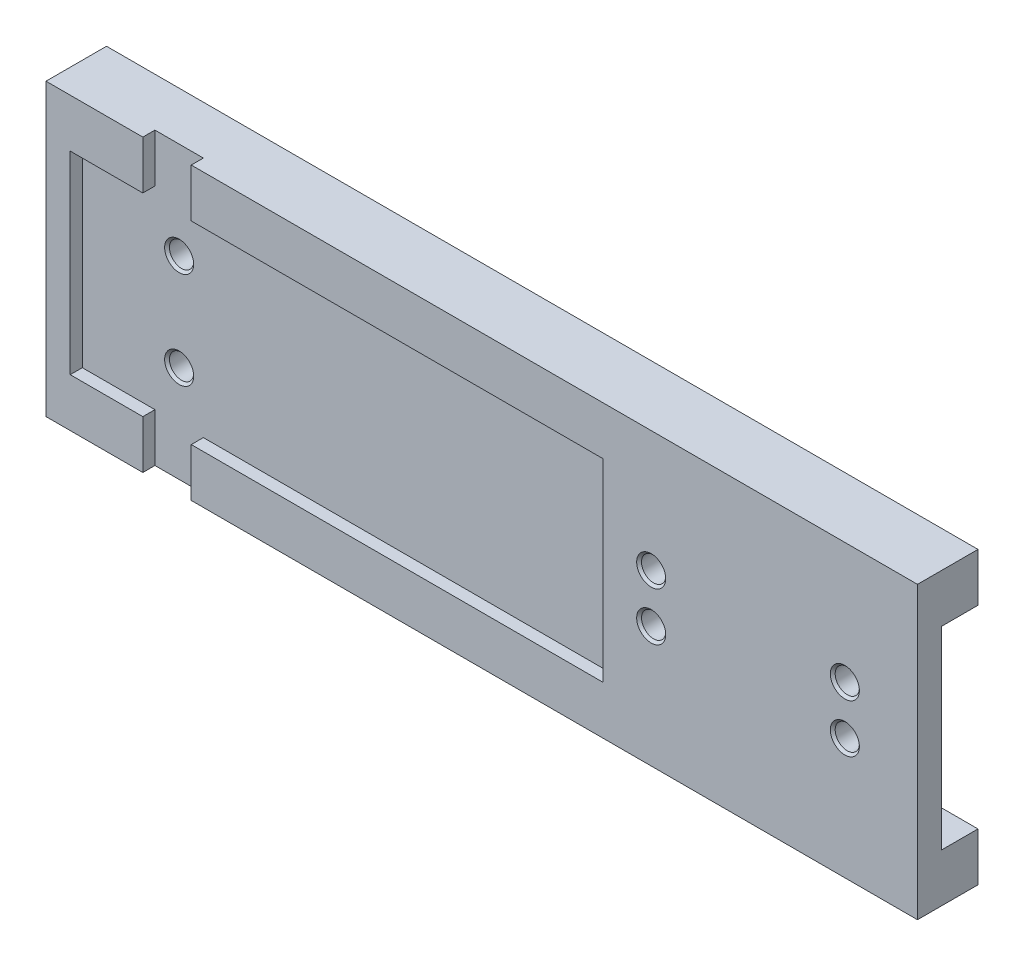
ISO-10303-21;
HEADER;
FILE_DESCRIPTION(('STEP AP214'),'2;1');
FILE_NAME('part.step','',(''),(''),'','','');
FILE_SCHEMA(('AUTOMOTIVE_DESIGN { 1 0 10303 214 1 1 1 1 }'));
ENDSEC;
DATA;
#1=APPLICATION_CONTEXT('core data for automotive mechanical design processes');
#2=APPLICATION_PROTOCOL_DEFINITION('international standard','automotive_design',2000,#1);
#3=PRODUCT_CONTEXT('',#1,'mechanical');
#4=PRODUCT('Part','Part','',(#3));
#5=PRODUCT_RELATED_PRODUCT_CATEGORY('part','',(#4));
#6=PRODUCT_DEFINITION_FORMATION('','',#4);
#7=PRODUCT_DEFINITION_CONTEXT('part definition',#1,'design');
#8=PRODUCT_DEFINITION('design','',#6,#7);
#9=PRODUCT_DEFINITION_SHAPE('','',#8);
#10=(LENGTH_UNIT() NAMED_UNIT(*) SI_UNIT(.MILLI.,.METRE.));
#11=(NAMED_UNIT(*) PLANE_ANGLE_UNIT() SI_UNIT($,.RADIAN.));
#12=(NAMED_UNIT(*) SI_UNIT($,.STERADIAN.) SOLID_ANGLE_UNIT());
#13=UNCERTAINTY_MEASURE_WITH_UNIT(LENGTH_MEASURE(1.E-05),#10,'distance_accuracy_value','');
#14=(GEOMETRIC_REPRESENTATION_CONTEXT(3) GLOBAL_UNCERTAINTY_ASSIGNED_CONTEXT((#13)) GLOBAL_UNIT_ASSIGNED_CONTEXT((#10,
#11,#12)) REPRESENTATION_CONTEXT('',''));
#15=CARTESIAN_POINT('',(0.,0.,0.));
#16=DIRECTION('',(0.,0.,1.));
#17=DIRECTION('',(1.,0.,0.));
#18=AXIS2_PLACEMENT_3D('',#15,#16,#17);
#19=CARTESIAN_POINT('',(0.,0.,15.875));
#20=DIRECTION('',(0.,0.,1.));
#21=DIRECTION('',(1.,0.,0.));
#22=AXIS2_PLACEMENT_3D('',#19,#20,#21);
#23=PLANE('',#22);
#24=DIRECTION('',(0.,-1.,0.));
#25=VECTOR('',#24,1.);
#26=CARTESIAN_POINT('',(-70.0537945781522,46.7138704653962,15.875));
#27=LINE('',#26,#25);
#28=CARTESIAN_POINT('',(-70.0537945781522,46.7138704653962,15.875));
#29=VERTEX_POINT('',#28);
#30=CARTESIAN_POINT('',(-70.0537945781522,34.0138704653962,15.875));
#31=VERTEX_POINT('',#30);
#32=EDGE_CURVE('E254',#29,#31,#27,.T.);
#33=ORIENTED_EDGE('',*,*,#32,.F.);
#34=DIRECTION('',(-1.,0.,0.));
#35=VECTOR('',#34,1.);
#36=CARTESIAN_POINT('',(-95.4537945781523,46.7138704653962,15.875));
#37=LINE('',#36,#35);
#38=CARTESIAN_POINT('',(-95.4537945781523,46.7138704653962,15.875));
#39=VERTEX_POINT('',#38);
#40=EDGE_CURVE('E354',#29,#39,#37,.T.);
#41=ORIENTED_EDGE('',*,*,#40,.T.);
#42=DIRECTION('',(0.,-1.,0.));
#43=VECTOR('',#42,1.);
#44=CARTESIAN_POINT('',(-95.4537945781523,46.7138704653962,15.875));
#45=LINE('',#44,#43);
#46=CARTESIAN_POINT('',(-95.4537945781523,-29.4861295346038,15.875));
#47=VERTEX_POINT('',#46);
#48=EDGE_CURVE('E341',#39,#47,#45,.T.);
#49=ORIENTED_EDGE('',*,*,#48,.T.);
#50=DIRECTION('',(1.,0.,0.));
#51=VECTOR('',#50,1.);
#52=CARTESIAN_POINT('',(-95.4537945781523,-29.4861295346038,15.875));
#53=LINE('',#52,#51);
#54=CARTESIAN_POINT('',(-70.0537945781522,-29.4861295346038,15.875));
#55=VERTEX_POINT('',#54);
#56=EDGE_CURVE('E347',#47,#55,#53,.T.);
#57=ORIENTED_EDGE('',*,*,#56,.T.);
#58=CARTESIAN_POINT('',(-70.0537945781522,-16.7861295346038,15.875));
#59=VERTEX_POINT('',#58);
#60=EDGE_CURVE('E238',#59,#55,#27,.T.);
#61=ORIENTED_EDGE('',*,*,#60,.F.);
#62=DIRECTION('',(1.,0.,0.));
#63=VECTOR('',#62,1.);
#64=CARTESIAN_POINT('',(-89.1037945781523,-16.7861295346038,15.875));
#65=LINE('',#64,#63);
#66=CARTESIAN_POINT('',(-89.1037945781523,-16.7861295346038,15.875));
#67=VERTEX_POINT('',#66);
#68=EDGE_CURVE('E314',#67,#59,#65,.T.);
#69=ORIENTED_EDGE('',*,*,#68,.F.);
#70=DIRECTION('',(0.,-1.,0.));
#71=VECTOR('',#70,1.);
#72=CARTESIAN_POINT('',(-89.1037945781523,34.0138704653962,15.875));
#73=LINE('',#72,#71);
#74=CARTESIAN_POINT('',(-89.1037945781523,34.0138704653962,15.875));
#75=VERTEX_POINT('',#74);
#76=EDGE_CURVE('E290',#75,#67,#73,.T.);
#77=ORIENTED_EDGE('',*,*,#76,.F.);
#78=DIRECTION('',(-1.,0.,0.));
#79=VECTOR('',#78,1.);
#80=CARTESIAN_POINT('',(-89.1037945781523,34.0138704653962,15.875));
#81=LINE('',#80,#79);
#82=EDGE_CURVE('E322',#31,#75,#81,.T.);
#83=ORIENTED_EDGE('',*,*,#82,.F.);
#84=EDGE_LOOP('',(#33,#41,#49,#57,#61,#69,#77,#83));
#85=FACE_BOUND('',#84,.T.);
#86=ADVANCED_FACE('F39',(#85),#23,.T.);
#87=CARTESIAN_POINT('',(-89.1037945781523,34.0138704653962,12.7));
#88=DIRECTION('',(0.,1.,0.));
#89=DIRECTION('',(0.,0.,1.));
#90=AXIS2_PLACEMENT_3D('',#87,#88,#89);
#91=PLANE('',#90);
#92=DIRECTION('',(-1.,0.,0.));
#93=VECTOR('',#92,1.);
#94=CARTESIAN_POINT('',(-89.1037945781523,34.0138704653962,12.7));
#95=LINE('',#94,#93);
#96=CARTESIAN_POINT('',(-70.0537945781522,34.0138704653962,12.7));
#97=VERTEX_POINT('',#96);
#98=CARTESIAN_POINT('',(-89.1037945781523,34.0138704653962,12.7));
#99=VERTEX_POINT('',#98);
#100=EDGE_CURVE('E305',#97,#99,#95,.T.);
#101=ORIENTED_EDGE('',*,*,#100,.F.);
#102=DIRECTION('',(0.,0.,1.));
#103=VECTOR('',#102,1.);
#104=CARTESIAN_POINT('',(-70.0537945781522,34.0138704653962,12.7));
#105=LINE('',#104,#103);
#106=EDGE_CURVE('E286',#97,#31,#105,.T.);
#107=ORIENTED_EDGE('',*,*,#106,.T.);
#108=ORIENTED_EDGE('',*,*,#82,.T.);
#109=DIRECTION('',(0.,0.,1.));
#110=VECTOR('',#109,1.);
#111=CARTESIAN_POINT('',(-89.1037945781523,34.0138704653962,12.7));
#112=LINE('',#111,#110);
#113=EDGE_CURVE('E326',#99,#75,#112,.T.);
#114=ORIENTED_EDGE('',*,*,#113,.F.);
#115=EDGE_LOOP('',(#101,#107,#108,#114));
#116=FACE_BOUND('',#115,.T.);
#117=ADVANCED_FACE('F497',(#116),#91,.F.);
#118=CARTESIAN_POINT('',(-89.1037945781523,-16.7861295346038,12.7));
#119=DIRECTION('',(0.,-1.,0.));
#120=DIRECTION('',(0.,0.,-1.));
#121=AXIS2_PLACEMENT_3D('',#118,#119,#120);
#122=PLANE('',#121);
#123=ORIENTED_EDGE('',*,*,#68,.T.);
#124=DIRECTION('',(0.,0.,-1.));
#125=VECTOR('',#124,1.);
#126=CARTESIAN_POINT('',(-70.0537945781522,-16.7861295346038,12.7));
#127=LINE('',#126,#125);
#128=CARTESIAN_POINT('',(-70.0537945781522,-16.7861295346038,12.7));
#129=VERTEX_POINT('',#128);
#130=EDGE_CURVE('E282',#59,#129,#127,.T.);
#131=ORIENTED_EDGE('',*,*,#130,.T.);
#132=DIRECTION('',(1.,0.,0.));
#133=VECTOR('',#132,1.);
#134=CARTESIAN_POINT('',(-89.1037945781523,-16.7861295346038,12.7));
#135=LINE('',#134,#133);
#136=CARTESIAN_POINT('',(-89.1037945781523,-16.7861295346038,12.7));
#137=VERTEX_POINT('',#136);
#138=EDGE_CURVE('E297',#137,#129,#135,.T.);
#139=ORIENTED_EDGE('',*,*,#138,.F.);
#140=DIRECTION('',(0.,0.,1.));
#141=VECTOR('',#140,1.);
#142=CARTESIAN_POINT('',(-89.1037945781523,-16.7861295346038,12.7));
#143=LINE('',#142,#141);
#144=EDGE_CURVE('E310',#137,#67,#143,.T.);
#145=ORIENTED_EDGE('',*,*,#144,.T.);
#146=EDGE_LOOP('',(#123,#131,#139,#145));
#147=FACE_BOUND('',#146,.T.);
#148=ADVANCED_FACE('F488',(#147),#122,.F.);
#149=CARTESIAN_POINT('',(-95.4537945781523,46.7138704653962,15.875));
#150=DIRECTION('',(1.,0.,0.));
#151=DIRECTION('',(0.,0.,-1.));
#152=AXIS2_PLACEMENT_3D('',#149,#150,#151);
#153=PLANE('',#152);
#154=DIRECTION('',(0.,-1.,0.));
#155=VECTOR('',#154,1.);
#156=CARTESIAN_POINT('',(-95.4537945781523,46.7138704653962,0.));
#157=LINE('',#156,#155);
#158=CARTESIAN_POINT('',(-95.4537945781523,46.7138704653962,0.));
#159=VERTEX_POINT('',#158);
#160=CARTESIAN_POINT('',(-95.4537945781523,-29.4861295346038,0.));
#161=VERTEX_POINT('',#160);
#162=EDGE_CURVE('E330',#159,#161,#157,.T.);
#163=ORIENTED_EDGE('',*,*,#162,.T.);
#164=DIRECTION('',(0.,0.,-1.));
#165=VECTOR('',#164,1.);
#166=CARTESIAN_POINT('',(-95.4537945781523,-29.4861295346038,15.875));
#167=LINE('',#166,#165);
#168=EDGE_CURVE('E11',#47,#161,#167,.T.);
#169=ORIENTED_EDGE('',*,*,#168,.F.);
#170=ORIENTED_EDGE('',*,*,#48,.F.);
#171=DIRECTION('',(0.,0.,-1.));
#172=VECTOR('',#171,1.);
#173=CARTESIAN_POINT('',(-95.4537945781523,46.7138704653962,15.875));
#174=LINE('',#173,#172);
#175=EDGE_CURVE('E359',#39,#159,#174,.T.);
#176=ORIENTED_EDGE('',*,*,#175,.T.);
#177=EDGE_LOOP('',(#163,#169,#170,#176));
#178=FACE_BOUND('',#177,.T.);
#179=ADVANCED_FACE('F41',(#178),#153,.F.);
#180=CARTESIAN_POINT('',(-95.4537945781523,-29.4861295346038,15.875));
#181=DIRECTION('',(0.,1.,0.));
#182=DIRECTION('',(0.,0.,1.));
#183=AXIS2_PLACEMENT_3D('',#180,#181,#182);
#184=PLANE('',#183);
#185=DIRECTION('',(1.,0.,0.));
#186=VECTOR('',#185,1.);
#187=CARTESIAN_POINT('',(-70.0537945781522,-29.4861295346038,12.7));
#188=LINE('',#187,#186);
#189=CARTESIAN_POINT('',(-70.0537945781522,-29.4861295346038,12.7));
#190=VERTEX_POINT('',#189);
#191=CARTESIAN_POINT('',(-57.3537945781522,-29.4861295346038,12.7));
#192=VERTEX_POINT('',#191);
#193=EDGE_CURVE('E241',#190,#192,#188,.T.);
#194=ORIENTED_EDGE('',*,*,#193,.F.);
#195=DIRECTION('',(0.,0.,1.));
#196=VECTOR('',#195,1.);
#197=CARTESIAN_POINT('',(-70.0537945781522,-29.4861295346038,12.7));
#198=LINE('',#197,#196);
#199=EDGE_CURVE('E253',#190,#55,#198,.T.);
#200=ORIENTED_EDGE('',*,*,#199,.T.);
#201=ORIENTED_EDGE('',*,*,#56,.F.);
#202=ORIENTED_EDGE('',*,*,#168,.T.);
#203=DIRECTION('',(1.,0.,0.));
#204=VECTOR('',#203,1.);
#205=CARTESIAN_POINT('',(-95.4537945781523,-29.4861295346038,0.));
#206=LINE('',#205,#204);
#207=CARTESIAN_POINT('',(133.146205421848,-29.4861295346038,0.));
#208=VERTEX_POINT('',#207);
#209=EDGE_CURVE('E363',#161,#208,#206,.T.);
#210=ORIENTED_EDGE('',*,*,#209,.T.);
#211=DIRECTION('',(0.,0.,-1.));
#212=VECTOR('',#211,1.);
#213=CARTESIAN_POINT('',(133.146205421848,-29.4861295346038,15.875));
#214=LINE('',#213,#212);
#215=CARTESIAN_POINT('',(133.146205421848,-29.4861295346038,15.875));
#216=VERTEX_POINT('',#215);
#217=EDGE_CURVE('E49',#216,#208,#214,.T.);
#218=ORIENTED_EDGE('',*,*,#217,.F.);
#219=CARTESIAN_POINT('',(-57.3537945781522,-29.4861295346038,15.875));
#220=VERTEX_POINT('',#219);
#221=EDGE_CURVE('E345',#220,#216,#53,.T.);
#222=ORIENTED_EDGE('',*,*,#221,.F.);
#223=DIRECTION('',(0.,0.,1.));
#224=VECTOR('',#223,1.);
#225=CARTESIAN_POINT('',(-57.3537945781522,-29.4861295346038,12.7));
#226=LINE('',#225,#224);
#227=EDGE_CURVE('E269',#192,#220,#226,.T.);
#228=ORIENTED_EDGE('',*,*,#227,.F.);
#229=EDGE_LOOP('',(#194,#200,#201,#202,#210,#218,#222,#228));
#230=FACE_BOUND('',#229,.T.);
#231=ADVANCED_FACE('F462',(#230),#184,.F.);
#232=CARTESIAN_POINT('',(133.146205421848,46.7138704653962,15.875));
#233=DIRECTION('',(-1.,0.,0.));
#234=DIRECTION('',(0.,0.,1.));
#235=AXIS2_PLACEMENT_3D('',#232,#233,#234);
#236=PLANE('',#235);
#237=DIRECTION('',(0.,-1.,0.));
#238=VECTOR('',#237,1.);
#239=CARTESIAN_POINT('',(133.146205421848,34.0138704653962,9.525));
#240=LINE('',#239,#238);
#241=CARTESIAN_POINT('',(133.146205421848,34.0138704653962,9.525));
#242=VERTEX_POINT('',#241);
#243=CARTESIAN_POINT('',(133.146205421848,-16.7861295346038,9.525));
#244=VERTEX_POINT('',#243);
#245=EDGE_CURVE('E187',#242,#244,#240,.T.);
#246=ORIENTED_EDGE('',*,*,#245,.F.);
#247=DIRECTION('',(0.,0.,-1.));
#248=VECTOR('',#247,1.);
#249=CARTESIAN_POINT('',(133.146205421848,34.0138704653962,9.525));
#250=LINE('',#249,#248);
#251=CARTESIAN_POINT('',(133.146205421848,34.0138704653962,0.));
#252=VERTEX_POINT('',#251);
#253=EDGE_CURVE('E218',#242,#252,#250,.T.);
#254=ORIENTED_EDGE('',*,*,#253,.T.);
#255=DIRECTION('',(0.,1.,0.));
#256=VECTOR('',#255,1.);
#257=CARTESIAN_POINT('',(133.146205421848,46.7138704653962,0.));
#258=LINE('',#257,#256);
#259=CARTESIAN_POINT('',(133.146205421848,46.7138704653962,0.));
#260=VERTEX_POINT('',#259);
#261=EDGE_CURVE('E366',#252,#260,#258,.T.);
#262=ORIENTED_EDGE('',*,*,#261,.T.);
#263=DIRECTION('',(0.,0.,-1.));
#264=VECTOR('',#263,1.);
#265=CARTESIAN_POINT('',(133.146205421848,46.7138704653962,15.875));
#266=LINE('',#265,#264);
#267=CARTESIAN_POINT('',(133.146205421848,46.7138704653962,15.875));
#268=VERTEX_POINT('',#267);
#269=EDGE_CURVE('E374',#268,#260,#266,.T.);
#270=ORIENTED_EDGE('',*,*,#269,.F.);
#271=DIRECTION('',(0.,1.,0.));
#272=VECTOR('',#271,1.);
#273=CARTESIAN_POINT('',(133.146205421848,46.7138704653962,15.875));
#274=LINE('',#273,#272);
#275=EDGE_CURVE('E351',#216,#268,#274,.T.);
#276=ORIENTED_EDGE('',*,*,#275,.F.);
#277=ORIENTED_EDGE('',*,*,#217,.T.);
#278=CARTESIAN_POINT('',(133.146205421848,-16.7861295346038,0.));
#279=VERTEX_POINT('',#278);
#280=EDGE_CURVE('E203',#208,#279,#258,.T.);
#281=ORIENTED_EDGE('',*,*,#280,.T.);
#282=DIRECTION('',(0.,0.,-1.));
#283=VECTOR('',#282,1.);
#284=CARTESIAN_POINT('',(133.146205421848,-16.7861295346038,9.525));
#285=LINE('',#284,#283);
#286=EDGE_CURVE('E57',#244,#279,#285,.T.);
#287=ORIENTED_EDGE('',*,*,#286,.F.);
#288=EDGE_LOOP('',(#246,#254,#262,#270,#276,#277,#281,#287));
#289=FACE_BOUND('',#288,.T.);
#290=ADVANCED_FACE('F200',(#289),#236,.F.);
#291=CARTESIAN_POINT('',(-95.4537945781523,46.7138704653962,15.875));
#292=DIRECTION('',(0.,-1.,0.));
#293=DIRECTION('',(0.,0.,-1.));
#294=AXIS2_PLACEMENT_3D('',#291,#292,#293);
#295=PLANE('',#294);
#296=ORIENTED_EDGE('',*,*,#40,.F.);
#297=DIRECTION('',(0.,0.,1.));
#298=VECTOR('',#297,1.);
#299=CARTESIAN_POINT('',(-70.0537945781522,46.7138704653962,12.7));
#300=LINE('',#299,#298);
#301=CARTESIAN_POINT('',(-70.0537945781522,46.7138704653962,12.7));
#302=VERTEX_POINT('',#301);
#303=EDGE_CURVE('E261',#302,#29,#300,.T.);
#304=ORIENTED_EDGE('',*,*,#303,.F.);
#305=DIRECTION('',(-1.,0.,0.));
#306=VECTOR('',#305,1.);
#307=CARTESIAN_POINT('',(-70.0537945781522,46.7138704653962,12.7));
#308=LINE('',#307,#306);
#309=CARTESIAN_POINT('',(-57.3537945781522,46.7138704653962,12.7));
#310=VERTEX_POINT('',#309);
#311=EDGE_CURVE('E250',#310,#302,#308,.T.);
#312=ORIENTED_EDGE('',*,*,#311,.F.);
#313=DIRECTION('',(0.,0.,1.));
#314=VECTOR('',#313,1.);
#315=CARTESIAN_POINT('',(-57.3537945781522,46.7138704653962,12.7));
#316=LINE('',#315,#314);
#317=CARTESIAN_POINT('',(-57.3537945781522,46.7138704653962,15.875));
#318=VERTEX_POINT('',#317);
#319=EDGE_CURVE('E265',#310,#318,#316,.T.);
#320=ORIENTED_EDGE('',*,*,#319,.T.);
#321=EDGE_CURVE('E355',#268,#318,#37,.T.);
#322=ORIENTED_EDGE('',*,*,#321,.F.);
#323=ORIENTED_EDGE('',*,*,#269,.T.);
#324=DIRECTION('',(-1.,0.,0.));
#325=VECTOR('',#324,1.);
#326=CARTESIAN_POINT('',(-95.4537945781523,46.7138704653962,0.));
#327=LINE('',#326,#325);
#328=EDGE_CURVE('E346',#260,#159,#327,.T.);
#329=ORIENTED_EDGE('',*,*,#328,.T.);
#330=ORIENTED_EDGE('',*,*,#175,.F.);
#331=EDGE_LOOP('',(#296,#304,#312,#320,#322,#323,#329,#330));
#332=FACE_BOUND('',#331,.T.);
#333=ADVANCED_FACE('F502',(#332),#295,.F.);
#334=CARTESIAN_POINT('',(63.2962054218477,14.9638704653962,15.875));
#335=DIRECTION('',(0.,0.,1.));
#336=DIRECTION('',(1.,0.,0.));
#337=AXIS2_PLACEMENT_3D('',#334,#335,#336);
#338=CIRCLE('',#337,3.80999999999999);
#339=CARTESIAN_POINT('',(67.1062054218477,14.9638704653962,15.875));
#340=VERTEX_POINT('',#339);
#341=EDGE_CURVE('E547',#340,#340,#338,.T.);
#342=ORIENTED_EDGE('',*,*,#341,.F.);
#343=EDGE_LOOP('',(#342));
#344=FACE_BOUND('',#343,.T.);
#345=CARTESIAN_POINT('',(63.2962054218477,2.26387046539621,15.875));
#346=DIRECTION('',(0.,0.,1.));
#347=DIRECTION('',(1.,0.,0.));
#348=AXIS2_PLACEMENT_3D('',#345,#346,#347);
#349=CIRCLE('',#348,3.80999999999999);
#350=CARTESIAN_POINT('',(67.1062054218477,2.26387046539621,15.875));
#351=VERTEX_POINT('',#350);
#352=EDGE_CURVE('E403',#351,#351,#349,.T.);
#353=ORIENTED_EDGE('',*,*,#352,.F.);
#354=EDGE_LOOP('',(#353));
#355=FACE_BOUND('',#354,.T.);
#356=CARTESIAN_POINT('',(114.096205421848,2.22979205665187,15.875));
#357=DIRECTION('',(0.,0.,1.));
#358=DIRECTION('',(1.,0.,0.));
#359=AXIS2_PLACEMENT_3D('',#356,#357,#358);
#360=CIRCLE('',#359,3.80999999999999);
#361=CARTESIAN_POINT('',(117.906205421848,2.22979205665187,15.875));
#362=VERTEX_POINT('',#361);
#363=EDGE_CURVE('E394',#362,#362,#360,.T.);
#364=ORIENTED_EDGE('',*,*,#363,.F.);
#365=EDGE_LOOP('',(#364));
#366=FACE_BOUND('',#365,.T.);
#367=CARTESIAN_POINT('',(114.096205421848,14.9638704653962,15.875));
#368=DIRECTION('',(0.,0.,1.));
#369=DIRECTION('',(1.,0.,0.));
#370=AXIS2_PLACEMENT_3D('',#367,#368,#369);
#371=CIRCLE('',#370,3.80999999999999);
#372=CARTESIAN_POINT('',(117.906205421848,14.9638704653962,15.875));
#373=VERTEX_POINT('',#372);
#374=EDGE_CURVE('E389',#373,#373,#371,.T.);
#375=ORIENTED_EDGE('',*,*,#374,.F.);
#376=EDGE_LOOP('',(#375));
#377=FACE_BOUND('',#376,.T.);
#378=DIRECTION('',(0.,1.,0.));
#379=VECTOR('',#378,1.);
#380=CARTESIAN_POINT('',(-57.3537945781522,46.7138704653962,15.875));
#381=LINE('',#380,#379);
#382=CARTESIAN_POINT('',(-57.3537945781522,-16.7861295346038,15.875));
#383=VERTEX_POINT('',#382);
#384=EDGE_CURVE('E258',#220,#383,#381,.T.);
#385=ORIENTED_EDGE('',*,*,#384,.F.);
#386=ORIENTED_EDGE('',*,*,#221,.T.);
#387=ORIENTED_EDGE('',*,*,#275,.T.);
#388=ORIENTED_EDGE('',*,*,#321,.T.);
#389=CARTESIAN_POINT('',(-57.3537945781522,34.0138704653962,15.875));
#390=VERTEX_POINT('',#389);
#391=EDGE_CURVE('E257',#390,#318,#381,.T.);
#392=ORIENTED_EDGE('',*,*,#391,.F.);
#393=CARTESIAN_POINT('',(50.5962054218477,34.0138704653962,15.875));
#394=VERTEX_POINT('',#393);
#395=EDGE_CURVE('E296',#394,#390,#81,.T.);
#396=ORIENTED_EDGE('',*,*,#395,.F.);
#397=DIRECTION('',(0.,1.,0.));
#398=VECTOR('',#397,1.);
#399=CARTESIAN_POINT('',(50.5962054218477,34.0138704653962,15.875));
#400=LINE('',#399,#398);
#401=CARTESIAN_POINT('',(50.5962054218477,-16.7861295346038,15.875));
#402=VERTEX_POINT('',#401);
#403=EDGE_CURVE('E318',#402,#394,#400,.T.);
#404=ORIENTED_EDGE('',*,*,#403,.F.);
#405=EDGE_CURVE('E313',#383,#402,#65,.T.);
#406=ORIENTED_EDGE('',*,*,#405,.F.);
#407=EDGE_LOOP('',(#385,#386,#387,#388,#392,#396,#404,#406));
#408=FACE_BOUND('',#407,.T.);
#409=ADVANCED_FACE('F476',(#344,#355,#366,#377,#408),#23,.T.);
#410=CARTESIAN_POINT('',(0.,0.,0.));
#411=DIRECTION('',(0.,0.,1.));
#412=DIRECTION('',(1.,0.,0.));
#413=AXIS2_PLACEMENT_3D('',#410,#411,#412);
#414=PLANE('',#413);
#415=CARTESIAN_POINT('',(-63.7037945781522,21.3138704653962,0.));
#416=DIRECTION('',(0.,0.,1.));
#417=DIRECTION('',(1.,0.,0.));
#418=AXIS2_PLACEMENT_3D('',#415,#416,#417);
#419=CIRCLE('',#418,3.175);
#420=CARTESIAN_POINT('',(-60.5287945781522,21.3138704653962,0.));
#421=VERTEX_POINT('',#420);
#422=EDGE_CURVE('E222',#421,#421,#419,.T.);
#423=ORIENTED_EDGE('',*,*,#422,.T.);
#424=EDGE_LOOP('',(#423));
#425=FACE_BOUND('',#424,.T.);
#426=CARTESIAN_POINT('',(-63.7037945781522,-4.08612953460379,0.));
#427=DIRECTION('',(0.,0.,1.));
#428=DIRECTION('',(1.,0.,0.));
#429=AXIS2_PLACEMENT_3D('',#426,#427,#428);
#430=CIRCLE('',#429,3.175);
#431=CARTESIAN_POINT('',(-60.5287945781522,-4.08612953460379,0.));
#432=VERTEX_POINT('',#431);
#433=EDGE_CURVE('E234',#432,#432,#430,.T.);
#434=ORIENTED_EDGE('',*,*,#433,.T.);
#435=EDGE_LOOP('',(#434));
#436=FACE_BOUND('',#435,.T.);
#437=ORIENTED_EDGE('',*,*,#261,.F.);
#438=DIRECTION('',(1.,0.,0.));
#439=VECTOR('',#438,1.);
#440=CARTESIAN_POINT('',(133.146205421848,34.0138704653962,0.));
#441=LINE('',#440,#439);
#442=CARTESIAN_POINT('',(56.9462054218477,34.0138704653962,0.));
#443=VERTEX_POINT('',#442);
#444=EDGE_CURVE('E197',#443,#252,#441,.T.);
#445=ORIENTED_EDGE('',*,*,#444,.F.);
#446=DIRECTION('',(0.,1.,0.));
#447=VECTOR('',#446,1.);
#448=CARTESIAN_POINT('',(56.9462054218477,34.0138704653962,0.));
#449=LINE('',#448,#447);
#450=CARTESIAN_POINT('',(56.9462054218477,-16.7861295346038,0.));
#451=VERTEX_POINT('',#450);
#452=EDGE_CURVE('E425',#451,#443,#449,.T.);
#453=ORIENTED_EDGE('',*,*,#452,.F.);
#454=DIRECTION('',(-1.,0.,0.));
#455=VECTOR('',#454,1.);
#456=CARTESIAN_POINT('',(133.146205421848,-16.7861295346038,0.));
#457=LINE('',#456,#455);
#458=EDGE_CURVE('E384',#279,#451,#457,.T.);
#459=ORIENTED_EDGE('',*,*,#458,.F.);
#460=ORIENTED_EDGE('',*,*,#280,.F.);
#461=ORIENTED_EDGE('',*,*,#209,.F.);
#462=ORIENTED_EDGE('',*,*,#162,.F.);
#463=ORIENTED_EDGE('',*,*,#328,.F.);
#464=EDGE_LOOP('',(#437,#445,#453,#459,#460,#461,#462,#463));
#465=FACE_BOUND('',#464,.T.);
#466=ADVANCED_FACE('F441',(#425,#436,#465),#414,.F.);
#467=CARTESIAN_POINT('',(-89.1037945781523,34.0138704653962,12.7));
#468=DIRECTION('',(-1.,0.,0.));
#469=DIRECTION('',(0.,0.,1.));
#470=AXIS2_PLACEMENT_3D('',#467,#468,#469);
#471=PLANE('',#470);
#472=ORIENTED_EDGE('',*,*,#76,.T.);
#473=ORIENTED_EDGE('',*,*,#144,.F.);
#474=DIRECTION('',(0.,-1.,0.));
#475=VECTOR('',#474,1.);
#476=CARTESIAN_POINT('',(-89.1037945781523,34.0138704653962,12.7));
#477=LINE('',#476,#475);
#478=EDGE_CURVE('E291',#99,#137,#477,.T.);
#479=ORIENTED_EDGE('',*,*,#478,.F.);
#480=ORIENTED_EDGE('',*,*,#113,.T.);
#481=EDGE_LOOP('',(#472,#473,#479,#480));
#482=FACE_BOUND('',#481,.T.);
#483=ADVANCED_FACE('F492',(#482),#471,.F.);
#484=ORIENTED_EDGE('',*,*,#395,.T.);
#485=DIRECTION('',(0.,0.,-1.));
#486=VECTOR('',#485,1.);
#487=CARTESIAN_POINT('',(-57.3537945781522,34.0138704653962,12.7));
#488=LINE('',#487,#486);
#489=CARTESIAN_POINT('',(-57.3537945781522,34.0138704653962,12.7));
#490=VERTEX_POINT('',#489);
#491=EDGE_CURVE('E278',#390,#490,#488,.T.);
#492=ORIENTED_EDGE('',*,*,#491,.T.);
#493=CARTESIAN_POINT('',(50.5962054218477,34.0138704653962,12.7));
#494=VERTEX_POINT('',#493);
#495=EDGE_CURVE('E306',#494,#490,#95,.T.);
#496=ORIENTED_EDGE('',*,*,#495,.F.);
#497=DIRECTION('',(0.,0.,1.));
#498=VECTOR('',#497,1.);
#499=CARTESIAN_POINT('',(50.5962054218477,34.0138704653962,12.7));
#500=LINE('',#499,#498);
#501=EDGE_CURVE('E331',#494,#394,#500,.T.);
#502=ORIENTED_EDGE('',*,*,#501,.T.);
#503=EDGE_LOOP('',(#484,#492,#496,#502));
#504=FACE_BOUND('',#503,.T.);
#505=ADVANCED_FACE('F510',(#504),#91,.F.);
#506=CARTESIAN_POINT('',(50.5962054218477,34.0138704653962,12.7));
#507=DIRECTION('',(1.,0.,0.));
#508=DIRECTION('',(0.,1.,0.));
#509=AXIS2_PLACEMENT_3D('',#506,#507,#508);
#510=PLANE('',#509);
#511=ORIENTED_EDGE('',*,*,#403,.T.);
#512=ORIENTED_EDGE('',*,*,#501,.F.);
#513=DIRECTION('',(0.,1.,0.));
#514=VECTOR('',#513,1.);
#515=CARTESIAN_POINT('',(50.5962054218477,34.0138704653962,12.7));
#516=LINE('',#515,#514);
#517=CARTESIAN_POINT('',(50.5962054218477,-16.7861295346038,12.7));
#518=VERTEX_POINT('',#517);
#519=EDGE_CURVE('E301',#518,#494,#516,.T.);
#520=ORIENTED_EDGE('',*,*,#519,.F.);
#521=DIRECTION('',(0.,0.,1.));
#522=VECTOR('',#521,1.);
#523=CARTESIAN_POINT('',(50.5962054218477,-16.7861295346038,12.7));
#524=LINE('',#523,#522);
#525=EDGE_CURVE('E334',#518,#402,#524,.T.);
#526=ORIENTED_EDGE('',*,*,#525,.T.);
#527=EDGE_LOOP('',(#511,#512,#520,#526));
#528=FACE_BOUND('',#527,.T.);
#529=ADVANCED_FACE('F514',(#528),#510,.F.);
#530=CARTESIAN_POINT('',(-57.3537945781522,-16.7861295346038,12.7));
#531=VERTEX_POINT('',#530);
#532=EDGE_CURVE('E295',#531,#518,#135,.T.);
#533=ORIENTED_EDGE('',*,*,#532,.F.);
#534=DIRECTION('',(0.,0.,1.));
#535=VECTOR('',#534,1.);
#536=CARTESIAN_POINT('',(-57.3537945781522,-16.7861295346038,12.7));
#537=LINE('',#536,#535);
#538=EDGE_CURVE('E264',#531,#383,#537,.T.);
#539=ORIENTED_EDGE('',*,*,#538,.T.);
#540=ORIENTED_EDGE('',*,*,#405,.T.);
#541=ORIENTED_EDGE('',*,*,#525,.F.);
#542=EDGE_LOOP('',(#533,#539,#540,#541));
#543=FACE_BOUND('',#542,.T.);
#544=ADVANCED_FACE('F517',(#543),#122,.F.);
#545=CARTESIAN_POINT('',(0.,0.,12.7));
#546=DIRECTION('',(0.,0.,1.));
#547=DIRECTION('',(1.,0.,0.));
#548=AXIS2_PLACEMENT_3D('',#545,#546,#547);
#549=PLANE('',#548);
#550=CARTESIAN_POINT('',(-63.7037945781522,21.3138704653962,12.7));
#551=DIRECTION('',(0.,0.,1.));
#552=DIRECTION('',(1.,0.,0.));
#553=AXIS2_PLACEMENT_3D('',#550,#551,#552);
#554=CIRCLE('',#553,3.81);
#555=CARTESIAN_POINT('',(-59.8937945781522,21.3138704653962,12.7));
#556=VERTEX_POINT('',#555);
#557=EDGE_CURVE('E213',#556,#556,#554,.T.);
#558=ORIENTED_EDGE('',*,*,#557,.F.);
#559=EDGE_LOOP('',(#558));
#560=FACE_BOUND('',#559,.T.);
#561=CARTESIAN_POINT('',(-63.7037945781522,-4.08612953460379,12.7));
#562=DIRECTION('',(0.,0.,1.));
#563=DIRECTION('',(1.,0.,0.));
#564=AXIS2_PLACEMENT_3D('',#561,#562,#563);
#565=CIRCLE('',#564,3.81);
#566=CARTESIAN_POINT('',(-59.8937945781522,-4.08612953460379,12.7));
#567=VERTEX_POINT('',#566);
#568=EDGE_CURVE('E226',#567,#567,#565,.T.);
#569=ORIENTED_EDGE('',*,*,#568,.F.);
#570=EDGE_LOOP('',(#569));
#571=FACE_BOUND('',#570,.T.);
#572=ORIENTED_EDGE('',*,*,#495,.T.);
#573=DIRECTION('',(0.,1.,0.));
#574=VECTOR('',#573,1.);
#575=CARTESIAN_POINT('',(-57.3537945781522,46.7138704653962,12.7));
#576=LINE('',#575,#574);
#577=EDGE_CURVE('E246',#490,#310,#576,.T.);
#578=ORIENTED_EDGE('',*,*,#577,.T.);
#579=ORIENTED_EDGE('',*,*,#311,.T.);
#580=DIRECTION('',(0.,-1.,0.));
#581=VECTOR('',#580,1.);
#582=CARTESIAN_POINT('',(-70.0537945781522,46.7138704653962,12.7));
#583=LINE('',#582,#581);
#584=EDGE_CURVE('E65',#302,#97,#583,.T.);
#585=ORIENTED_EDGE('',*,*,#584,.T.);
#586=ORIENTED_EDGE('',*,*,#100,.T.);
#587=ORIENTED_EDGE('',*,*,#478,.T.);
#588=ORIENTED_EDGE('',*,*,#138,.T.);
#589=EDGE_CURVE('E242',#129,#190,#583,.T.);
#590=ORIENTED_EDGE('',*,*,#589,.T.);
#591=ORIENTED_EDGE('',*,*,#193,.T.);
#592=EDGE_CURVE('E247',#192,#531,#576,.T.);
#593=ORIENTED_EDGE('',*,*,#592,.T.);
#594=ORIENTED_EDGE('',*,*,#532,.T.);
#595=ORIENTED_EDGE('',*,*,#519,.T.);
#596=EDGE_LOOP('',(#572,#578,#579,#585,#586,#587,#588,#590,#591,#593,#594,#595));
#597=FACE_BOUND('',#596,.T.);
#598=ADVANCED_FACE('F485',(#560,#571,#597),#549,.T.);
#599=CARTESIAN_POINT('',(-57.3537945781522,46.7138704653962,12.7));
#600=DIRECTION('',(1.,0.,0.));
#601=DIRECTION('',(0.,1.,0.));
#602=AXIS2_PLACEMENT_3D('',#599,#600,#601);
#603=PLANE('',#602);
#604=ORIENTED_EDGE('',*,*,#592,.F.);
#605=ORIENTED_EDGE('',*,*,#227,.T.);
#606=ORIENTED_EDGE('',*,*,#384,.T.);
#607=ORIENTED_EDGE('',*,*,#538,.F.);
#608=EDGE_LOOP('',(#604,#605,#606,#607));
#609=FACE_BOUND('',#608,.T.);
#610=ADVANCED_FACE('F482',(#609),#603,.F.);
#611=CARTESIAN_POINT('',(-70.0537945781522,46.7138704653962,12.7));
#612=DIRECTION('',(-1.,0.,0.));
#613=DIRECTION('',(0.,0.,1.));
#614=AXIS2_PLACEMENT_3D('',#611,#612,#613);
#615=PLANE('',#614);
#616=ORIENTED_EDGE('',*,*,#60,.T.);
#617=ORIENTED_EDGE('',*,*,#199,.F.);
#618=ORIENTED_EDGE('',*,*,#589,.F.);
#619=ORIENTED_EDGE('',*,*,#130,.F.);
#620=EDGE_LOOP('',(#616,#617,#618,#619));
#621=FACE_BOUND('',#620,.T.);
#622=ADVANCED_FACE('F457',(#621),#615,.F.);
#623=ORIENTED_EDGE('',*,*,#584,.F.);
#624=ORIENTED_EDGE('',*,*,#303,.T.);
#625=ORIENTED_EDGE('',*,*,#32,.T.);
#626=ORIENTED_EDGE('',*,*,#106,.F.);
#627=EDGE_LOOP('',(#623,#624,#625,#626));
#628=FACE_BOUND('',#627,.T.);
#629=ADVANCED_FACE('F499',(#628),#615,.F.);
#630=ORIENTED_EDGE('',*,*,#391,.T.);
#631=ORIENTED_EDGE('',*,*,#319,.F.);
#632=ORIENTED_EDGE('',*,*,#577,.F.);
#633=ORIENTED_EDGE('',*,*,#491,.F.);
#634=EDGE_LOOP('',(#630,#631,#632,#633));
#635=FACE_BOUND('',#634,.T.);
#636=ADVANCED_FACE('F506',(#635),#603,.F.);
#637=CARTESIAN_POINT('',(-63.7037945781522,-4.08612953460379,12.7));
#638=DIRECTION('',(0.,0.,1.));
#639=DIRECTION('',(1.,0.,0.));
#640=AXIS2_PLACEMENT_3D('',#637,#638,#639);
#641=CYLINDRICAL_SURFACE('',#640,3.175);
#642=ORIENTED_EDGE('',*,*,#433,.F.);
#643=EDGE_LOOP('',(#642));
#644=FACE_BOUND('',#643,.T.);
#645=CARTESIAN_POINT('',(-63.7037945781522,-4.08612953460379,12.065));
#646=DIRECTION('',(0.,0.,1.));
#647=DIRECTION('',(1.,0.,0.));
#648=AXIS2_PLACEMENT_3D('',#645,#646,#647);
#649=CIRCLE('',#648,3.175);
#650=CARTESIAN_POINT('',(-60.5287945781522,-4.08612953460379,12.065));
#651=VERTEX_POINT('',#650);
#652=EDGE_CURVE('E230',#651,#651,#649,.T.);
#653=ORIENTED_EDGE('',*,*,#652,.T.);
#654=EDGE_LOOP('',(#653));
#655=FACE_BOUND('',#654,.T.);
#656=ADVANCED_FACE('F592',(#644,#655),#641,.F.);
#657=CARTESIAN_POINT('',(-63.7037945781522,-4.08612953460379,12.7));
#658=DIRECTION('',(0.,0.,1.));
#659=DIRECTION('',(1.,0.,0.));
#660=AXIS2_PLACEMENT_3D('',#657,#658,#659);
#661=CONICAL_SURFACE('',#660,3.81,0.78539816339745);
#662=ORIENTED_EDGE('',*,*,#652,.F.);
#663=EDGE_LOOP('',(#662));
#664=FACE_BOUND('',#663,.T.);
#665=ORIENTED_EDGE('',*,*,#568,.T.);
#666=EDGE_LOOP('',(#665));
#667=FACE_BOUND('',#666,.T.);
#668=ADVANCED_FACE('F588',(#664,#667),#661,.F.);
#669=CARTESIAN_POINT('',(-63.7037945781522,21.3138704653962,12.7));
#670=DIRECTION('',(0.,0.,1.));
#671=DIRECTION('',(1.,0.,0.));
#672=AXIS2_PLACEMENT_3D('',#669,#670,#671);
#673=CYLINDRICAL_SURFACE('',#672,3.175);
#674=ORIENTED_EDGE('',*,*,#422,.F.);
#675=EDGE_LOOP('',(#674));
#676=FACE_BOUND('',#675,.T.);
#677=CARTESIAN_POINT('',(-63.7037945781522,21.3138704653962,12.065));
#678=DIRECTION('',(0.,0.,1.));
#679=DIRECTION('',(1.,0.,0.));
#680=AXIS2_PLACEMENT_3D('',#677,#678,#679);
#681=CIRCLE('',#680,3.175);
#682=CARTESIAN_POINT('',(-60.5287945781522,21.3138704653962,12.065));
#683=VERTEX_POINT('',#682);
#684=EDGE_CURVE('E217',#683,#683,#681,.T.);
#685=ORIENTED_EDGE('',*,*,#684,.T.);
#686=EDGE_LOOP('',(#685));
#687=FACE_BOUND('',#686,.T.);
#688=ADVANCED_FACE('F584',(#676,#687),#673,.F.);
#689=CARTESIAN_POINT('',(-63.7037945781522,21.3138704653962,12.7));
#690=DIRECTION('',(0.,0.,1.));
#691=DIRECTION('',(1.,0.,0.));
#692=AXIS2_PLACEMENT_3D('',#689,#690,#691);
#693=CONICAL_SURFACE('',#692,3.81,0.78539816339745);
#694=ORIENTED_EDGE('',*,*,#684,.F.);
#695=EDGE_LOOP('',(#694));
#696=FACE_BOUND('',#695,.T.);
#697=ORIENTED_EDGE('',*,*,#557,.T.);
#698=EDGE_LOOP('',(#697));
#699=FACE_BOUND('',#698,.T.);
#700=ADVANCED_FACE('F577',(#696,#699),#693,.F.);
#701=CARTESIAN_POINT('',(133.146205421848,34.0138704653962,9.525));
#702=DIRECTION('',(0.,1.,0.));
#703=DIRECTION('',(0.,0.,1.));
#704=AXIS2_PLACEMENT_3D('',#701,#702,#703);
#705=PLANE('',#704);
#706=ORIENTED_EDGE('',*,*,#444,.T.);
#707=ORIENTED_EDGE('',*,*,#253,.F.);
#708=DIRECTION('',(1.,0.,0.));
#709=VECTOR('',#708,1.);
#710=CARTESIAN_POINT('',(133.146205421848,34.0138704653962,9.525));
#711=LINE('',#710,#709);
#712=CARTESIAN_POINT('',(56.9462054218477,34.0138704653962,9.525));
#713=VERTEX_POINT('',#712);
#714=EDGE_CURVE('E193',#713,#242,#711,.T.);
#715=ORIENTED_EDGE('',*,*,#714,.F.);
#716=DIRECTION('',(0.,0.,-1.));
#717=VECTOR('',#716,1.);
#718=CARTESIAN_POINT('',(56.9462054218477,34.0138704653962,9.525));
#719=LINE('',#718,#717);
#720=EDGE_CURVE('E208',#713,#443,#719,.T.);
#721=ORIENTED_EDGE('',*,*,#720,.T.);
#722=EDGE_LOOP('',(#706,#707,#715,#721));
#723=FACE_BOUND('',#722,.T.);
#724=ADVANCED_FACE('F434',(#723),#705,.F.);
#725=CARTESIAN_POINT('',(56.9462054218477,34.0138704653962,9.525));
#726=DIRECTION('',(-1.,0.,0.));
#727=DIRECTION('',(0.,-1.,0.));
#728=AXIS2_PLACEMENT_3D('',#725,#726,#727);
#729=PLANE('',#728);
#730=ORIENTED_EDGE('',*,*,#452,.T.);
#731=ORIENTED_EDGE('',*,*,#720,.F.);
#732=DIRECTION('',(0.,1.,0.));
#733=VECTOR('',#732,1.);
#734=CARTESIAN_POINT('',(56.9462054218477,34.0138704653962,9.525));
#735=LINE('',#734,#733);
#736=CARTESIAN_POINT('',(56.9462054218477,-16.7861295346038,9.525));
#737=VERTEX_POINT('',#736);
#738=EDGE_CURVE('E186',#737,#713,#735,.T.);
#739=ORIENTED_EDGE('',*,*,#738,.F.);
#740=DIRECTION('',(0.,0.,-1.));
#741=VECTOR('',#740,1.);
#742=CARTESIAN_POINT('',(56.9462054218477,-16.7861295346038,9.525));
#743=LINE('',#742,#741);
#744=EDGE_CURVE('E181',#737,#451,#743,.T.);
#745=ORIENTED_EDGE('',*,*,#744,.T.);
#746=EDGE_LOOP('',(#730,#731,#739,#745));
#747=FACE_BOUND('',#746,.T.);
#748=ADVANCED_FACE('F438',(#747),#729,.F.);
#749=CARTESIAN_POINT('',(133.146205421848,-16.7861295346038,9.525));
#750=DIRECTION('',(0.,-1.,0.));
#751=DIRECTION('',(1.,0.,0.));
#752=AXIS2_PLACEMENT_3D('',#749,#750,#751);
#753=PLANE('',#752);
#754=ORIENTED_EDGE('',*,*,#458,.T.);
#755=ORIENTED_EDGE('',*,*,#744,.F.);
#756=DIRECTION('',(-1.,0.,0.));
#757=VECTOR('',#756,1.);
#758=CARTESIAN_POINT('',(133.146205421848,-16.7861295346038,9.525));
#759=LINE('',#758,#757);
#760=EDGE_CURVE('E178',#244,#737,#759,.T.);
#761=ORIENTED_EDGE('',*,*,#760,.F.);
#762=ORIENTED_EDGE('',*,*,#286,.T.);
#763=EDGE_LOOP('',(#754,#755,#761,#762));
#764=FACE_BOUND('',#763,.T.);
#765=ADVANCED_FACE('F180',(#764),#753,.F.);
#766=CARTESIAN_POINT('',(0.,0.,9.525));
#767=DIRECTION('',(0.,0.,-1.));
#768=DIRECTION('',(-1.,0.,0.));
#769=AXIS2_PLACEMENT_3D('',#766,#767,#768);
#770=PLANE('',#769);
#771=CARTESIAN_POINT('',(63.2962054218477,14.9638704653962,9.525));
#772=DIRECTION('',(0.,0.,-1.));
#773=DIRECTION('',(-1.,0.,0.));
#774=AXIS2_PLACEMENT_3D('',#771,#772,#773);
#775=CIRCLE('',#774,3.17499999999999);
#776=CARTESIAN_POINT('',(60.1212054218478,14.9638704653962,9.525));
#777=VERTEX_POINT('',#776);
#778=EDGE_CURVE('E43',#777,#777,#775,.T.);
#779=ORIENTED_EDGE('',*,*,#778,.F.);
#780=EDGE_LOOP('',(#779));
#781=FACE_BOUND('',#780,.T.);
#782=CARTESIAN_POINT('',(63.2962054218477,2.26387046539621,9.525));
#783=DIRECTION('',(0.,0.,-1.));
#784=DIRECTION('',(-1.,0.,0.));
#785=AXIS2_PLACEMENT_3D('',#782,#783,#784);
#786=CIRCLE('',#785,3.17499999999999);
#787=CARTESIAN_POINT('',(60.1212054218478,2.26387046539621,9.525));
#788=VERTEX_POINT('',#787);
#789=EDGE_CURVE('E391',#788,#788,#786,.T.);
#790=ORIENTED_EDGE('',*,*,#789,.F.);
#791=EDGE_LOOP('',(#790));
#792=FACE_BOUND('',#791,.T.);
#793=CARTESIAN_POINT('',(114.096205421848,2.22979205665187,9.525));
#794=DIRECTION('',(0.,0.,-1.));
#795=DIRECTION('',(-1.,0.,0.));
#796=AXIS2_PLACEMENT_3D('',#793,#794,#795);
#797=CIRCLE('',#796,3.17499999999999);
#798=CARTESIAN_POINT('',(110.921205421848,2.22979205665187,9.525));
#799=VERTEX_POINT('',#798);
#800=EDGE_CURVE('E386',#799,#799,#797,.T.);
#801=ORIENTED_EDGE('',*,*,#800,.F.);
#802=EDGE_LOOP('',(#801));
#803=FACE_BOUND('',#802,.T.);
#804=CARTESIAN_POINT('',(114.096205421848,14.9638704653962,9.525));
#805=DIRECTION('',(0.,0.,-1.));
#806=DIRECTION('',(-1.,0.,0.));
#807=AXIS2_PLACEMENT_3D('',#804,#805,#806);
#808=CIRCLE('',#807,3.17499999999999);
#809=CARTESIAN_POINT('',(110.921205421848,14.9638704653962,9.525));
#810=VERTEX_POINT('',#809);
#811=EDGE_CURVE('E380',#810,#810,#808,.T.);
#812=ORIENTED_EDGE('',*,*,#811,.F.);
#813=EDGE_LOOP('',(#812));
#814=FACE_BOUND('',#813,.T.);
#815=ORIENTED_EDGE('',*,*,#245,.T.);
#816=ORIENTED_EDGE('',*,*,#760,.T.);
#817=ORIENTED_EDGE('',*,*,#738,.T.);
#818=ORIENTED_EDGE('',*,*,#714,.T.);
#819=EDGE_LOOP('',(#815,#816,#817,#818));
#820=FACE_BOUND('',#819,.T.);
#821=ADVANCED_FACE('F191',(#781,#792,#803,#814,#820),#770,.T.);
#822=CARTESIAN_POINT('',(114.096205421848,14.9638704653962,15.875));
#823=DIRECTION('',(0.,0.,1.));
#824=DIRECTION('',(1.,0.,0.));
#825=AXIS2_PLACEMENT_3D('',#822,#823,#824);
#826=CYLINDRICAL_SURFACE('',#825,3.17499999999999);
#827=ORIENTED_EDGE('',*,*,#811,.T.);
#828=EDGE_LOOP('',(#827));
#829=FACE_BOUND('',#828,.T.);
#830=CARTESIAN_POINT('',(114.096205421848,14.9638704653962,15.24));
#831=DIRECTION('',(0.,0.,1.));
#832=DIRECTION('',(1.,0.,0.));
#833=AXIS2_PLACEMENT_3D('',#830,#831,#832);
#834=CIRCLE('',#833,3.17499999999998);
#835=CARTESIAN_POINT('',(117.271205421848,14.9638704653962,15.24));
#836=VERTEX_POINT('',#835);
#837=EDGE_CURVE('E385',#836,#836,#834,.T.);
#838=ORIENTED_EDGE('',*,*,#837,.T.);
#839=EDGE_LOOP('',(#838));
#840=FACE_BOUND('',#839,.T.);
#841=ADVANCED_FACE('F557',(#829,#840),#826,.F.);
#842=CARTESIAN_POINT('',(114.096205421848,14.9638704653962,15.875));
#843=DIRECTION('',(0.,0.,1.));
#844=DIRECTION('',(1.,0.,0.));
#845=AXIS2_PLACEMENT_3D('',#842,#843,#844);
#846=CONICAL_SURFACE('',#845,3.80999999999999,0.785398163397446);
#847=ORIENTED_EDGE('',*,*,#837,.F.);
#848=EDGE_LOOP('',(#847));
#849=FACE_BOUND('',#848,.T.);
#850=ORIENTED_EDGE('',*,*,#374,.T.);
#851=EDGE_LOOP('',(#850));
#852=FACE_BOUND('',#851,.T.);
#853=ADVANCED_FACE('F554',(#849,#852),#846,.F.);
#854=CARTESIAN_POINT('',(114.096205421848,2.22979205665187,15.875));
#855=DIRECTION('',(0.,0.,1.));
#856=DIRECTION('',(1.,0.,0.));
#857=AXIS2_PLACEMENT_3D('',#854,#855,#856);
#858=CYLINDRICAL_SURFACE('',#857,3.17499999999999);
#859=ORIENTED_EDGE('',*,*,#800,.T.);
#860=EDGE_LOOP('',(#859));
#861=FACE_BOUND('',#860,.T.);
#862=CARTESIAN_POINT('',(114.096205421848,2.22979205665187,15.24));
#863=DIRECTION('',(0.,0.,1.));
#864=DIRECTION('',(1.,0.,0.));
#865=AXIS2_PLACEMENT_3D('',#862,#863,#864);
#866=CIRCLE('',#865,3.17499999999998);
#867=CARTESIAN_POINT('',(117.271205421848,2.22979205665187,15.24));
#868=VERTEX_POINT('',#867);
#869=EDGE_CURVE('E390',#868,#868,#866,.T.);
#870=ORIENTED_EDGE('',*,*,#869,.T.);
#871=EDGE_LOOP('',(#870));
#872=FACE_BOUND('',#871,.T.);
#873=ADVANCED_FACE('F556',(#861,#872),#858,.F.);
#874=CARTESIAN_POINT('',(114.096205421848,2.22979205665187,15.875));
#875=DIRECTION('',(0.,0.,1.));
#876=DIRECTION('',(1.,0.,0.));
#877=AXIS2_PLACEMENT_3D('',#874,#875,#876);
#878=CONICAL_SURFACE('',#877,3.80999999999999,0.785398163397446);
#879=ORIENTED_EDGE('',*,*,#869,.F.);
#880=EDGE_LOOP('',(#879));
#881=FACE_BOUND('',#880,.T.);
#882=ORIENTED_EDGE('',*,*,#363,.T.);
#883=EDGE_LOOP('',(#882));
#884=FACE_BOUND('',#883,.T.);
#885=ADVANCED_FACE('F564',(#881,#884),#878,.F.);
#886=CARTESIAN_POINT('',(63.2962054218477,2.26387046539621,15.875));
#887=DIRECTION('',(0.,0.,1.));
#888=DIRECTION('',(1.,0.,0.));
#889=AXIS2_PLACEMENT_3D('',#886,#887,#888);
#890=CYLINDRICAL_SURFACE('',#889,3.17499999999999);
#891=ORIENTED_EDGE('',*,*,#789,.T.);
#892=EDGE_LOOP('',(#891));
#893=FACE_BOUND('',#892,.T.);
#894=CARTESIAN_POINT('',(63.2962054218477,2.26387046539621,15.24));
#895=DIRECTION('',(0.,0.,1.));
#896=DIRECTION('',(1.,0.,0.));
#897=AXIS2_PLACEMENT_3D('',#894,#895,#896);
#898=CIRCLE('',#897,3.17499999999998);
#899=CARTESIAN_POINT('',(66.4712054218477,2.26387046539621,15.24));
#900=VERTEX_POINT('',#899);
#901=EDGE_CURVE('E395',#900,#900,#898,.T.);
#902=ORIENTED_EDGE('',*,*,#901,.T.);
#903=EDGE_LOOP('',(#902));
#904=FACE_BOUND('',#903,.T.);
#905=ADVANCED_FACE('F672',(#893,#904),#890,.F.);
#906=CARTESIAN_POINT('',(63.2962054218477,2.26387046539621,15.875));
#907=DIRECTION('',(0.,0.,1.));
#908=DIRECTION('',(1.,0.,0.));
#909=AXIS2_PLACEMENT_3D('',#906,#907,#908);
#910=CONICAL_SURFACE('',#909,3.80999999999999,0.785398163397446);
#911=ORIENTED_EDGE('',*,*,#901,.F.);
#912=EDGE_LOOP('',(#911));
#913=FACE_BOUND('',#912,.T.);
#914=ORIENTED_EDGE('',*,*,#352,.T.);
#915=EDGE_LOOP('',(#914));
#916=FACE_BOUND('',#915,.T.);
#917=ADVANCED_FACE('F681',(#913,#916),#910,.F.);
#918=CARTESIAN_POINT('',(63.2962054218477,14.9638704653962,15.875));
#919=DIRECTION('',(0.,0.,1.));
#920=DIRECTION('',(1.,0.,0.));
#921=AXIS2_PLACEMENT_3D('',#918,#919,#920);
#922=CYLINDRICAL_SURFACE('',#921,3.17499999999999);
#923=ORIENTED_EDGE('',*,*,#778,.T.);
#924=EDGE_LOOP('',(#923));
#925=FACE_BOUND('',#924,.T.);
#926=CARTESIAN_POINT('',(63.2962054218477,14.9638704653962,15.24));
#927=DIRECTION('',(0.,0.,1.));
#928=DIRECTION('',(1.,0.,0.));
#929=AXIS2_PLACEMENT_3D('',#926,#927,#928);
#930=CIRCLE('',#929,3.17499999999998);
#931=CARTESIAN_POINT('',(66.4712054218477,14.9638704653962,15.24));
#932=VERTEX_POINT('',#931);
#933=EDGE_CURVE('E717',#932,#932,#930,.T.);
#934=ORIENTED_EDGE('',*,*,#933,.T.);
#935=EDGE_LOOP('',(#934));
#936=FACE_BOUND('',#935,.T.);
#937=ADVANCED_FACE('F690',(#925,#936),#922,.F.);
#938=CARTESIAN_POINT('',(63.2962054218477,14.9638704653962,15.875));
#939=DIRECTION('',(0.,0.,1.));
#940=DIRECTION('',(1.,0.,0.));
#941=AXIS2_PLACEMENT_3D('',#938,#939,#940);
#942=CONICAL_SURFACE('',#941,3.80999999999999,0.785398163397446);
#943=ORIENTED_EDGE('',*,*,#933,.F.);
#944=EDGE_LOOP('',(#943));
#945=FACE_BOUND('',#944,.T.);
#946=ORIENTED_EDGE('',*,*,#341,.T.);
#947=EDGE_LOOP('',(#946));
#948=FACE_BOUND('',#947,.T.);
#949=ADVANCED_FACE('F700',(#945,#948),#942,.F.);
#950=CLOSED_SHELL('',(#86,#117,#148,#179,#231,#290,#333,#409,#466,#483,#505,#529,#544,#598,#610,
#622,#629,#636,#656,#668,#688,#700,#724,#748,#765,#821,#841,#853,#873,#885,#905,#917,#937,#949));
#951=MANIFOLD_SOLID_BREP('B2',#950);
#952=ADVANCED_BREP_SHAPE_REPRESENTATION('',(#18,#951),#14);
#953=SHAPE_DEFINITION_REPRESENTATION(#9,#952);
ENDSEC;
END-ISO-10303-21;
